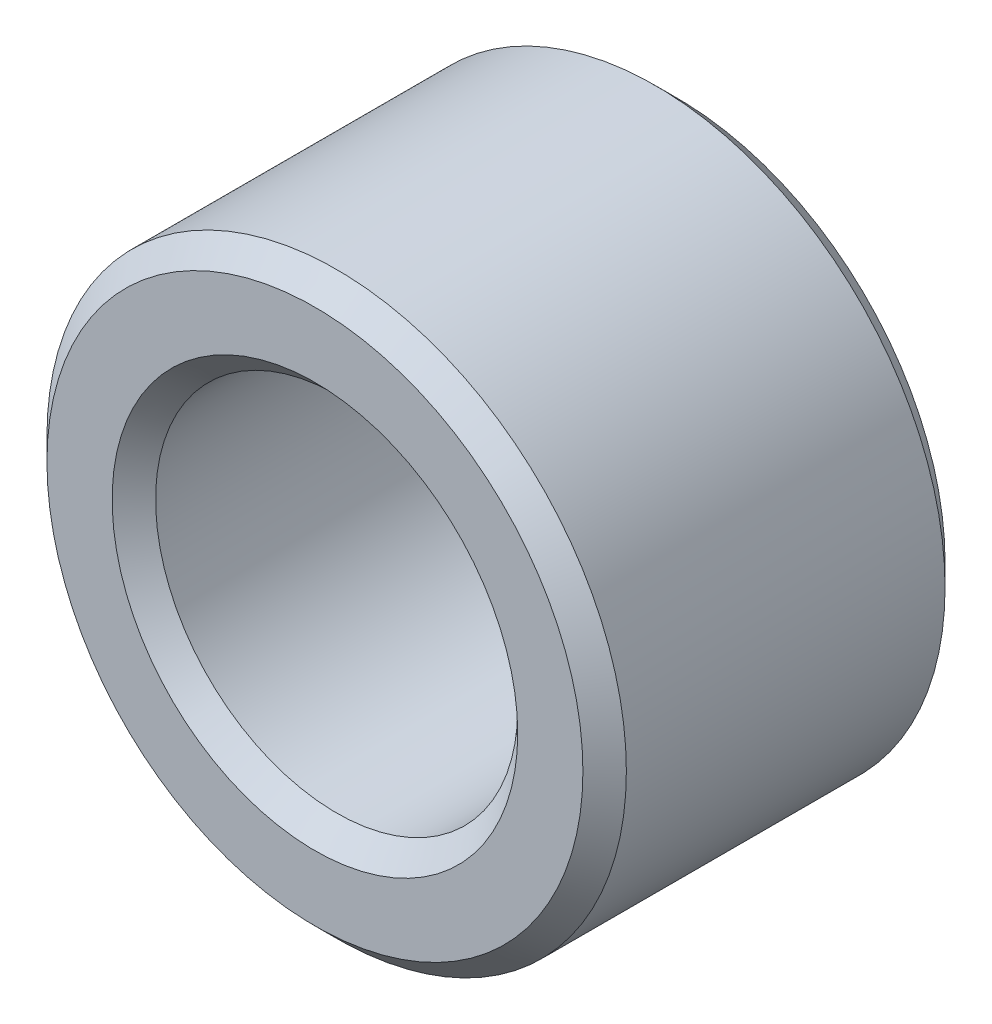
from build123d import *

# Parameters (mm, degrees)
ESQUISSE1_R          = 4
ESQUISSE1_R_2        = 2.5
BASE_EXTRUSION_DEPTH = 5
CHANFREIN1_SIZE      = 0.3


with BuildPart() as part:
    # Esquisse1 → Base-Extrusion (new body)
    with BuildSketch(Plane.XY):
        Circle(ESQUISSE1_R)
        Circle(ESQUISSE1_R_2, mode=Mode.SUBTRACT)
    extrude(amount=BASE_EXTRUSION_DEPTH)

    # Chanfrein1
    chanfrein1_edges = [part.edges().sort_by_distance(p)[0] for p in [
        (-4, 0, 0),
        (-4, 0, 5),
        (-2.5, 0, 0),
        (-2.5, 0, 5),
    ]]
    chamfer(chanfrein1_edges, length=CHANFREIN1_SIZE)


solid = part.part
